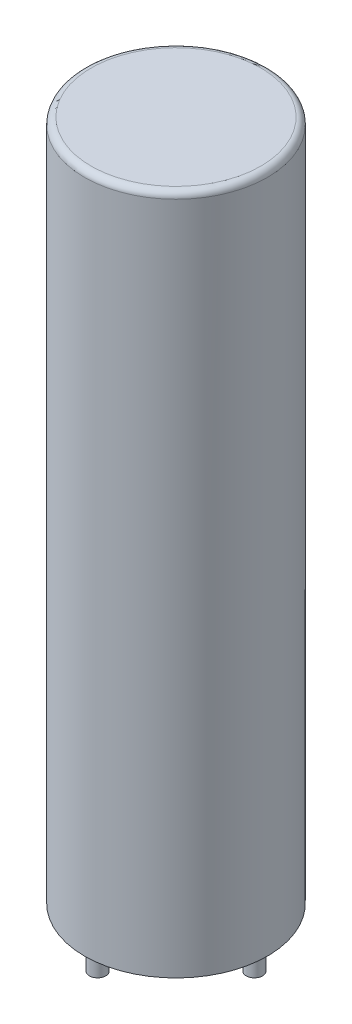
from build123d import *

# Parameters (mm, degrees)
SKETCH1_W           = 14
SKETCH1_H           = 120
SKETCH2_R           = 7.5
CUT_EXTRUDE1_DEPTH  = 15.8
SKETCH4_R           = 10
CUT_EXTRUDE2_DEPTH  = 9
CUT_EXTRUDE3_START  = 15.8
SKETCH5_R           = 14
CUT_EXTRUDE3_DEPTH  = 15.8
SKETCH6_R           = 1.25
BOSS_EXTRUDE1_DEPTH = 3
FILLET1_R           = 1


with BuildPart() as part:
    # Sketch1 → Revolve1 (revolve)
    with BuildSketch(Plane.XY, mode=Mode.PRIVATE) as revolve1_sk:
        with Locations((7, 60)):
            Rectangle(SKETCH1_W, SKETCH1_H)
    revolve(revolve1_sk.sketch.rotate(Axis((0, 120, 0), (0, -1, 0)), 180), axis=Axis((0, 120, 0), (0, -1, 0)))

    # Sketch2 → Cut-Extrude1 (cut)
    with BuildSketch(Plane.XZ):
        Circle(SKETCH2_R)
    extrude(amount=-CUT_EXTRUDE1_DEPTH, mode=Mode.SUBTRACT)

    # Sketch4 → Cut-Extrude2 (cut)
    with BuildSketch(Plane.XZ.offset(-15.8)):
        Circle(SKETCH4_R)
    extrude(amount=-CUT_EXTRUDE2_DEPTH, mode=Mode.SUBTRACT)

    # Sketch5 → Cut-Extrude3 (cut)
    with BuildSketch(Plane(origin=(0, 0, 0), x_dir=(1, 0, 0), z_dir=(0, 1, 0)).offset(CUT_EXTRUDE3_START)):
        with Locations(Location((0, 0, 0), (0, 0, 180))):
            Circle(SKETCH5_R)
    extrude(amount=-CUT_EXTRUDE3_DEPTH, mode=Mode.SUBTRACT)

    # Sketch6 → Boss-Extrude1 (add)
    with BuildSketch(Plane.XZ.offset(-15.8)):
        with Locations(Location((0, 12, 0), (0, 0, 90))):
            Circle(SKETCH6_R)
        with Locations(Location((12, 0, 0), (0, 0, 90))):
            Circle(SKETCH6_R)
        with Locations(Location((0, -12, 0), (0, 0, 90))):
            Circle(SKETCH6_R)
        with Locations(Location((-12, 0, 0), (0, 0, 90))):
            Circle(SKETCH6_R)
    extrude(amount=BOSS_EXTRUDE1_DEPTH)

    # Fillet1
    fillet1_edges = [part.edges().sort_by_distance(p)[0] for p in [
        (14, 120, 0),
    ]]
    fillet(fillet1_edges, radius=FILLET1_R)


solid = part.part
